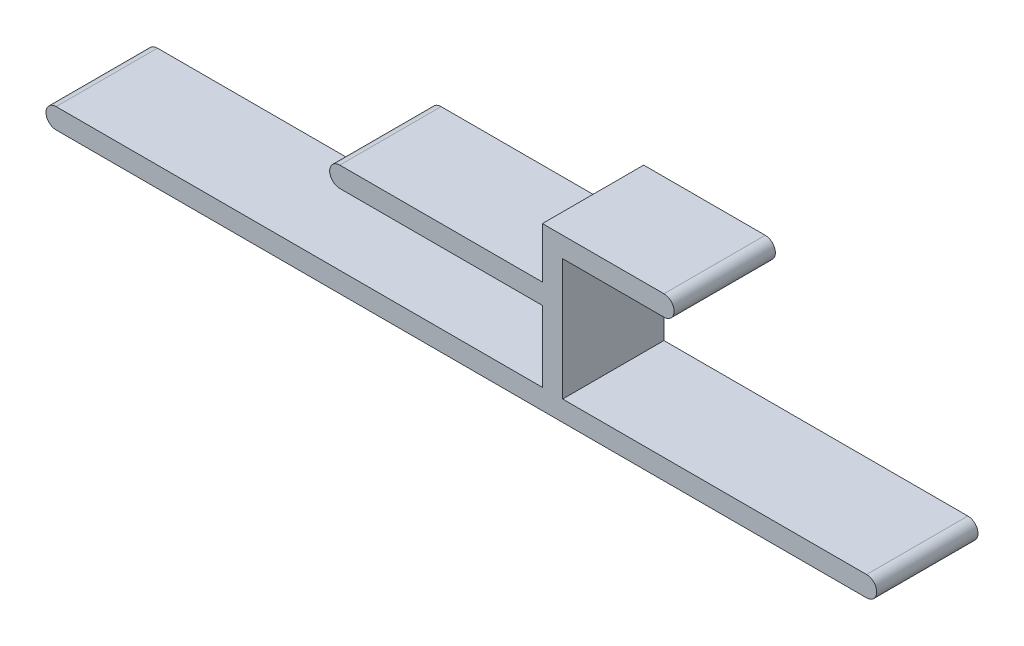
from build123d import *

# Parameters (mm, degrees)
BOSS_EXTRUDE1_DEPTH = 10


with BuildPart() as part:
    # Sketch1 → Boss-Extrude1 (new body)
    with BuildSketch(Plane(origin=(0, 0, 0), x_dir=(0, -1, 0), z_dir=(0, 0, 1))):
        with BuildLine():
            Line((0, -50), (0, -2))
            Line((0, -2), (-7, -2))
            Line((-7, -2), (-7, -22))
            ThreePointArc((-7, -22), (-8, -23), (-9, -22))
            Line((-9, -22), (-9, -2))
            Line((-9, -2), (-14, -2))
            Line((-14, -2), (-14, 10))
            ThreePointArc((-14, 10), (-13, 11), (-12, 10))
            Line((-12, 10), (-12, 0))
            Line((-12, 0), (0, 0))
            Line((0, 0), (0, 30))
            ThreePointArc((0, 30), (1, 31), (2, 30))
            Line((2, 30), (2, -50))
            ThreePointArc((2, -50), (1, -51), (0, -50))
        make_face()
    extrude(amount=BOSS_EXTRUDE1_DEPTH)


solid = part.part
